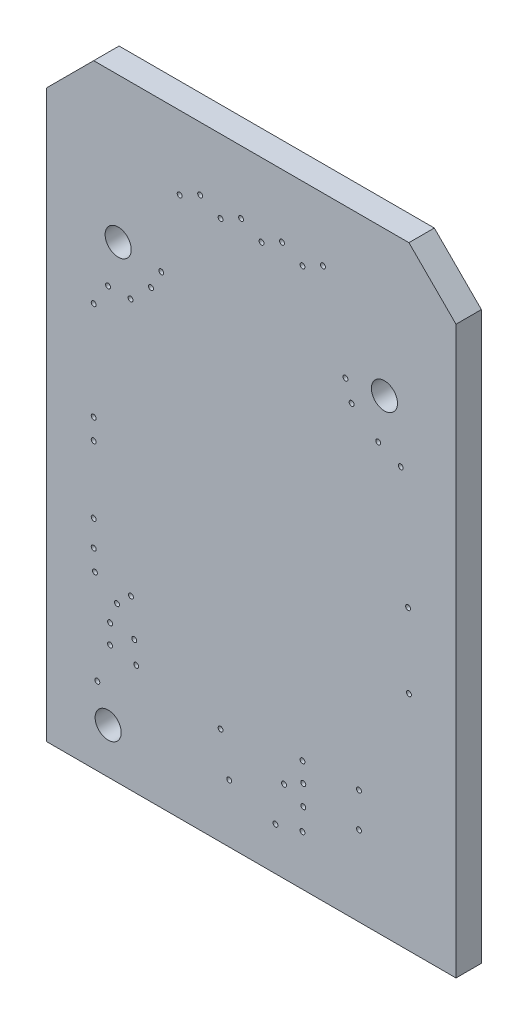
from build123d import *

# Parameters (mm, degrees)
BOARD_OUTLINE_DEPTH = 0.7874
SKETCH2_R           = 0.0762
NPTH_DEPTH          = 23.887669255
SKETCH3_R           = 0.405
PTH_DEPTH           = 23.887669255


with BuildPart() as part:
    # Sketch1 → Board_Outline (new body)
    with BuildSketch(Plane.XY):
        Polygon((0, 0), (12.7, 0), (12.7, 17.5641), (11.2395, 19.0246), (1.4605, 19.0246), (0, 17.5641), align=None)
    extrude(amount=BOARD_OUTLINE_DEPTH)

    # Sketch2 → NPTH (cut, through all)
    with BuildSketch(Plane.XY):
        with Locations((1.4605, 9.4488)):
            Circle(SKETCH2_R)
        with Locations((9.6901, 2.4765)):
            Circle(SKETCH2_R)
        with Locations((1.4986, 5.3086)):
            Circle(SKETCH2_R)
        with Locations((11.2141, 9.2075)):
            Circle(SKETCH2_R)
        with Locations((1.4605, 12.4968)):
            Circle(SKETCH2_R)
        with Locations((1.4605, 8.8138)):
            Circle(SKETCH2_R)
        with Locations((6.0325, 17.0688)):
            Circle(SKETCH2_R)
        with Locations((1.905, 13.1953)):
            Circle(SKETCH2_R)
        with Locations((5.3975, 16.7513)):
            Circle(SKETCH2_R)
        with Locations((2.6035, 13.1953)):
            Circle(SKETCH2_R)
        with Locations((4.7625, 17.0688)):
            Circle(SKETCH2_R)
        with Locations((3.2385, 13.8176)):
            Circle(SKETCH2_R)
        with Locations((4.1275, 16.7513)):
            Circle(SKETCH2_R)
        with Locations((3.556, 14.4018)):
            Circle(SKETCH2_R)
        with Locations((7.9629, 2.8575)):
            Circle(SKETCH2_R)
        with Locations((2.1844, 4.8006)):
            Circle(SKETCH2_R)
        with Locations((8.5725, 17.0688)):
            Circle(SKETCH2_R)
        with Locations((9.271, 14.4018)):
            Circle(SKETCH2_R)
        with Locations((7.9375, 16.7513)):
            Circle(SKETCH2_R)
        with Locations((9.4615, 13.8176)):
            Circle(SKETCH2_R)
        with Locations((7.3025, 17.0688)):
            Circle(SKETCH2_R)
        with Locations((10.287, 13.1953)):
            Circle(SKETCH2_R)
        with Locations((6.6675, 16.7513)):
            Circle(SKETCH2_R)
        with Locations((10.9855, 12.8778)):
            Circle(SKETCH2_R)
        with Locations((7.9375, 3.4544)):
            Circle(SKETCH2_R)
        with Locations((2.7813, 3.4417)):
            Circle(SKETCH2_R)
        with Locations((5.3975, 3.0353)):
            Circle(SKETCH2_R)
        with Locations((1.5748, 2.413)):
            Circle(SKETCH2_R)
        with Locations((7.9629, 2.2352)):
            Circle(SKETCH2_R)
        with Locations((2.6162, 5.2197)):
            Circle(SKETCH2_R)
        with Locations((5.6642, 1.8034)):
            Circle(SKETCH2_R)
        with Locations((7.9375, 1.5494)):
            Circle(SKETCH2_R)
        with Locations((7.0993, 1.3335)):
            Circle(SKETCH2_R)
        with Locations((7.366, 2.54)):
            Circle(SKETCH2_R)
        with Locations((1.4605, 6.731)):
            Circle(SKETCH2_R)
        with Locations((11.2395, 6.9088)):
            Circle(SKETCH2_R)
        with Locations((1.9685, 3.5814)):
            Circle(SKETCH2_R)
        with Locations((9.6901, 3.5433)):
            Circle(SKETCH2_R)
        with Locations((1.4605, 5.9309)):
            Circle(SKETCH2_R)
        with Locations((1.9685, 4.1783)):
            Circle(SKETCH2_R)
        with Locations((2.7178, 4.1021)):
            Circle(SKETCH2_R)
    extrude(amount=NPTH_DEPTH, mode=Mode.SUBTRACT)

    # Sketch3 → PTH (cut, through all)
    with BuildSketch(Plane.XY):
        with Locations((2.22, 14.53)):
            Circle(SKETCH3_R)
        with Locations((10.48, 14.53)):
            Circle(SKETCH3_R)
        with Locations((1.91, 1.4)):
            Circle(SKETCH3_R)
    extrude(amount=PTH_DEPTH, mode=Mode.SUBTRACT)


solid = part.part
